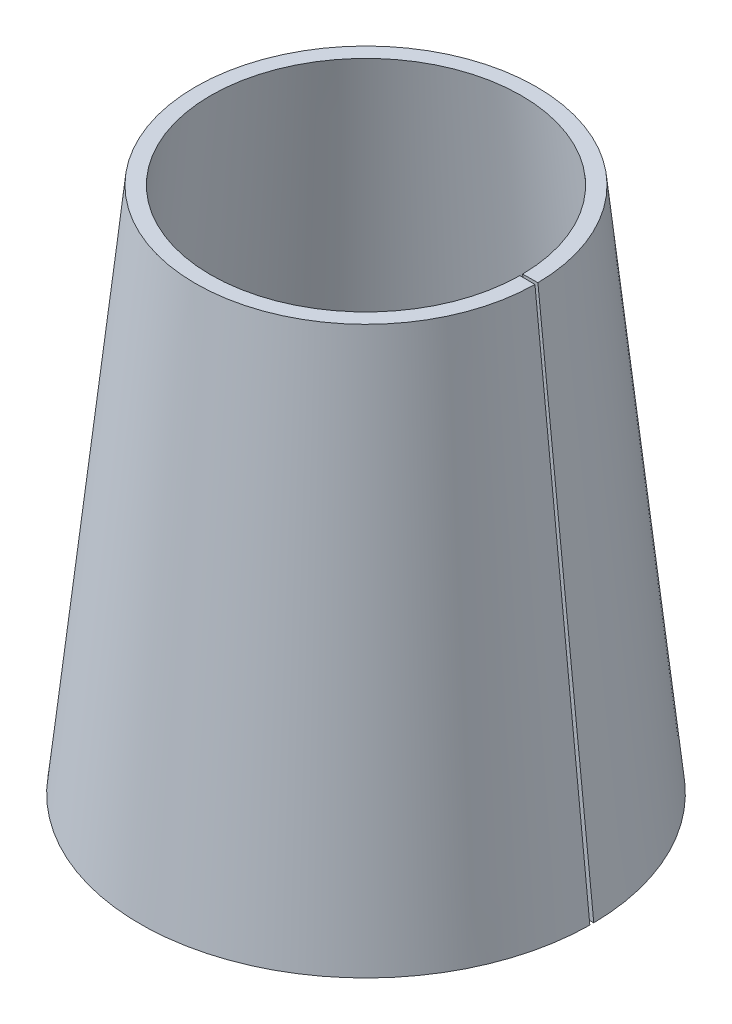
ISO-10303-21;
HEADER;
FILE_DESCRIPTION(('STEP AP214'),'2;1');
FILE_NAME('part.step','',(''),(''),'','','');
FILE_SCHEMA(('AUTOMOTIVE_DESIGN { 1 0 10303 214 1 1 1 1 }'));
ENDSEC;
DATA;
#1=APPLICATION_CONTEXT('core data for automotive mechanical design processes');
#2=APPLICATION_PROTOCOL_DEFINITION('international standard','automotive_design',2000,#1);
#3=PRODUCT_CONTEXT('',#1,'mechanical');
#4=PRODUCT('Part','Part','',(#3));
#5=PRODUCT_RELATED_PRODUCT_CATEGORY('part','',(#4));
#6=PRODUCT_DEFINITION_FORMATION('','',#4);
#7=PRODUCT_DEFINITION_CONTEXT('part definition',#1,'design');
#8=PRODUCT_DEFINITION('design','',#6,#7);
#9=PRODUCT_DEFINITION_SHAPE('','',#8);
#10=(LENGTH_UNIT() NAMED_UNIT(*) SI_UNIT(.MILLI.,.METRE.));
#11=(NAMED_UNIT(*) PLANE_ANGLE_UNIT() SI_UNIT($,.RADIAN.));
#12=(NAMED_UNIT(*) SI_UNIT($,.STERADIAN.) SOLID_ANGLE_UNIT());
#13=UNCERTAINTY_MEASURE_WITH_UNIT(LENGTH_MEASURE(1.E-05),#10,'distance_accuracy_value','');
#14=(GEOMETRIC_REPRESENTATION_CONTEXT(3) GLOBAL_UNCERTAINTY_ASSIGNED_CONTEXT((#13)) GLOBAL_UNIT_ASSIGNED_CONTEXT((#10,
#11,#12)) REPRESENTATION_CONTEXT('',''));
#15=CARTESIAN_POINT('',(0.,0.,0.));
#16=DIRECTION('',(0.,0.,1.));
#17=DIRECTION('',(1.,0.,0.));
#18=AXIS2_PLACEMENT_3D('',#15,#16,#17);
#19=CARTESIAN_POINT('',(0.,0.,0.));
#20=DIRECTION('',(0.,-1.,0.));
#21=DIRECTION('',(0.,0.,1.));
#22=AXIS2_PLACEMENT_3D('',#19,#20,#21);
#23=CONICAL_SURFACE('',#22,30.,0.10471975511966);
#24=DIRECTION('',(0.104524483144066,-0.994521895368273,0.000912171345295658));
#25=VECTOR('',#24,1.);
#26=CARTESIAN_POINT('',(0.,285.430933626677,0.));
#27=LINE('',#26,#25);
#28=CARTESIAN_POINT('',(22.6418413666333,70.,0.197592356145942));
#29=VERTEX_POINT('',#28);
#30=CARTESIAN_POINT('',(29.9988576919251,0.,0.261796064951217));
#31=VERTEX_POINT('',#30);
#32=EDGE_CURVE('E69',#29,#31,#27,.T.);
#33=ORIENTED_EDGE('',*,*,#32,.F.);
#34=CARTESIAN_POINT('',(0.,70.,0.));
#35=DIRECTION('',(0.,1.,0.));
#36=DIRECTION('',(0.,0.,1.));
#37=AXIS2_PLACEMENT_3D('',#34,#35,#36);
#38=CIRCLE('',#37,22.6427035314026);
#39=CARTESIAN_POINT('',(22.6418413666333,70.,-0.197592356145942));
#40=VERTEX_POINT('',#39);
#41=EDGE_CURVE('E90',#40,#29,#38,.T.);
#42=ORIENTED_EDGE('',*,*,#41,.F.);
#43=DIRECTION('',(-0.104524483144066,0.994521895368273,0.000912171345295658));
#44=VECTOR('',#43,1.);
#45=CARTESIAN_POINT('',(0.,285.430933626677,0.));
#46=LINE('',#45,#44);
#47=CARTESIAN_POINT('',(29.9988576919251,0.,-0.261796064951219));
#48=VERTEX_POINT('',#47);
#49=EDGE_CURVE('E78',#48,#40,#46,.T.);
#50=ORIENTED_EDGE('',*,*,#49,.F.);
#51=CARTESIAN_POINT('',(0.,0.,0.));
#52=DIRECTION('',(0.,1.,0.));
#53=DIRECTION('',(0.,0.,1.));
#54=AXIS2_PLACEMENT_3D('',#51,#52,#53);
#55=CIRCLE('',#54,30.);
#56=EDGE_CURVE('E85',#48,#31,#55,.T.);
#57=ORIENTED_EDGE('',*,*,#56,.T.);
#58=EDGE_LOOP('',(#33,#42,#50,#57));
#59=FACE_BOUND('',#58,.T.);
#60=ADVANCED_FACE('F32',(#59),#23,.T.);
#61=CARTESIAN_POINT('',(0.,70.,0.));
#62=DIRECTION('',(0.,1.,0.));
#63=DIRECTION('',(0.,0.,1.));
#64=AXIS2_PLACEMENT_3D('',#61,#62,#63);
#65=PLANE('',#64);
#66=ORIENTED_EDGE('',*,*,#41,.T.);
#67=DIRECTION('',(0.999961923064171,0.,0.00872653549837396));
#68=VECTOR('',#67,1.);
#69=CARTESIAN_POINT('',(0.,70.,0.));
#70=LINE('',#69,#68);
#71=CARTESIAN_POINT('',(20.6309013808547,70.,0.180043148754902));
#72=VERTEX_POINT('',#71);
#73=EDGE_CURVE('E72',#72,#29,#70,.T.);
#74=ORIENTED_EDGE('',*,*,#73,.F.);
#75=CARTESIAN_POINT('',(0.,70.,0.));
#76=DIRECTION('',(0.,1.,0.));
#77=DIRECTION('',(0.,0.,1.));
#78=AXIS2_PLACEMENT_3D('',#75,#76,#77);
#79=CIRCLE('',#78,20.6316869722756);
#80=CARTESIAN_POINT('',(20.6309013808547,70.,-0.180043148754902));
#81=VERTEX_POINT('',#80);
#82=EDGE_CURVE('E91',#81,#72,#79,.T.);
#83=ORIENTED_EDGE('',*,*,#82,.F.);
#84=DIRECTION('',(-0.999961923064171,0.,0.00872653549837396));
#85=VECTOR('',#84,1.);
#86=CARTESIAN_POINT('',(0.,70.,0.));
#87=LINE('',#86,#85);
#88=EDGE_CURVE('E53',#40,#81,#87,.T.);
#89=ORIENTED_EDGE('',*,*,#88,.F.);
#90=EDGE_LOOP('',(#66,#74,#83,#89));
#91=FACE_BOUND('',#90,.T.);
#92=ADVANCED_FACE('F101',(#91),#65,.T.);
#93=CARTESIAN_POINT('',(0.,0.,0.));
#94=DIRECTION('',(0.,1.,0.));
#95=DIRECTION('',(0.,0.,1.));
#96=AXIS2_PLACEMENT_3D('',#93,#94,#95);
#97=PLANE('',#96);
#98=DIRECTION('',(0.999961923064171,0.,0.00872653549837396));
#99=VECTOR('',#98,1.);
#100=CARTESIAN_POINT('',(0.,0.,0.));
#101=LINE('',#100,#99);
#102=CARTESIAN_POINT('',(27.9879177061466,0.,0.244246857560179));
#103=VERTEX_POINT('',#102);
#104=EDGE_CURVE('E46',#103,#31,#101,.T.);
#105=ORIENTED_EDGE('',*,*,#104,.T.);
#106=ORIENTED_EDGE('',*,*,#56,.F.);
#107=DIRECTION('',(-0.999961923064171,0.,0.00872653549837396));
#108=VECTOR('',#107,1.);
#109=CARTESIAN_POINT('',(0.,0.,0.));
#110=LINE('',#109,#108);
#111=CARTESIAN_POINT('',(27.9879177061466,0.,-0.244246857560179));
#112=VERTEX_POINT('',#111);
#113=EDGE_CURVE('E87',#48,#112,#110,.T.);
#114=ORIENTED_EDGE('',*,*,#113,.T.);
#115=CARTESIAN_POINT('',(0.,0.,0.));
#116=DIRECTION('',(0.,1.,0.));
#117=DIRECTION('',(0.,0.,1.));
#118=AXIS2_PLACEMENT_3D('',#115,#116,#117);
#119=CIRCLE('',#118,27.988983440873);
#120=EDGE_CURVE('E77',#112,#103,#119,.T.);
#121=ORIENTED_EDGE('',*,*,#120,.T.);
#122=EDGE_LOOP('',(#105,#106,#114,#121));
#123=FACE_BOUND('',#122,.T.);
#124=ADVANCED_FACE('F83',(#123),#97,.F.);
#125=CARTESIAN_POINT('',(0.,-0.209056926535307,0.));
#126=DIRECTION('',(0.,-1.,0.));
#127=DIRECTION('',(0.,0.,1.));
#128=AXIS2_PLACEMENT_3D('',#125,#126,#127);
#129=CONICAL_SURFACE('',#128,28.0109562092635,0.10471975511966);
#130=ORIENTED_EDGE('',*,*,#82,.T.);
#131=DIRECTION('',(0.104524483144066,-0.994521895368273,0.000912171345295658));
#132=VECTOR('',#131,1.);
#133=CARTESIAN_POINT('',(0.,266.297389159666,0.));
#134=LINE('',#133,#132);
#135=EDGE_CURVE('E11',#72,#103,#134,.T.);
#136=ORIENTED_EDGE('',*,*,#135,.T.);
#137=ORIENTED_EDGE('',*,*,#120,.F.);
#138=DIRECTION('',(-0.104524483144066,0.994521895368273,0.000912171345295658));
#139=VECTOR('',#138,1.);
#140=CARTESIAN_POINT('',(0.,266.297389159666,0.));
#141=LINE('',#140,#139);
#142=EDGE_CURVE('E39',#112,#81,#141,.T.);
#143=ORIENTED_EDGE('',*,*,#142,.T.);
#144=EDGE_LOOP('',(#130,#136,#137,#143));
#145=FACE_BOUND('',#144,.T.);
#146=ADVANCED_FACE('F99',(#145),#129,.F.);
#147=CARTESIAN_POINT('',(0.,70.,0.));
#148=DIRECTION('',(0.00872653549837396,0.,0.999961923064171));
#149=DIRECTION('',(0.999961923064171,0.,-0.00872653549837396));
#150=AXIS2_PLACEMENT_3D('',#147,#148,#149);
#151=PLANE('',#150);
#152=ORIENTED_EDGE('',*,*,#49,.T.);
#153=ORIENTED_EDGE('',*,*,#88,.T.);
#154=ORIENTED_EDGE('',*,*,#142,.F.);
#155=ORIENTED_EDGE('',*,*,#113,.F.);
#156=EDGE_LOOP('',(#152,#153,#154,#155));
#157=FACE_BOUND('',#156,.T.);
#158=ADVANCED_FACE('F106',(#157),#151,.T.);
#159=CARTESIAN_POINT('',(0.,70.,0.));
#160=DIRECTION('',(0.00872653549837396,0.,-0.999961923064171));
#161=DIRECTION('',(-0.999961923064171,0.,-0.00872653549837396));
#162=AXIS2_PLACEMENT_3D('',#159,#160,#161);
#163=PLANE('',#162);
#164=ORIENTED_EDGE('',*,*,#32,.T.);
#165=ORIENTED_EDGE('',*,*,#104,.F.);
#166=ORIENTED_EDGE('',*,*,#135,.F.);
#167=ORIENTED_EDGE('',*,*,#73,.T.);
#168=EDGE_LOOP('',(#164,#165,#166,#167));
#169=FACE_BOUND('',#168,.T.);
#170=ADVANCED_FACE('F70',(#169),#163,.T.);
#171=CLOSED_SHELL('',(#60,#92,#124,#146,#158,#170));
#172=MANIFOLD_SOLID_BREP('B2',#171);
#173=ADVANCED_BREP_SHAPE_REPRESENTATION('',(#18,#172),#14);
#174=SHAPE_DEFINITION_REPRESENTATION(#9,#173);
ENDSEC;
END-ISO-10303-21;
